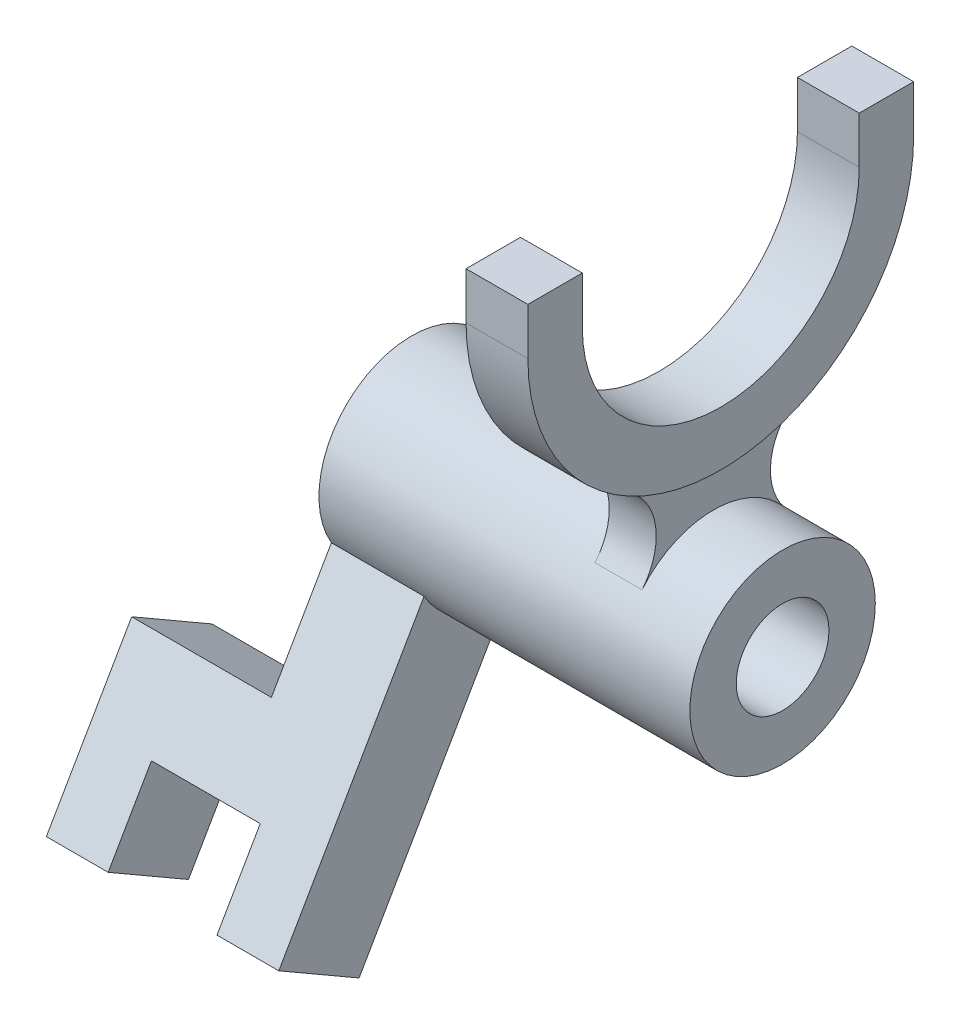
from build123d import *

# Parameters (mm, degrees)
BOSS_EXTRUDE2_DEPTH      = 19.05
BOSS_EXTRUDE2_DEPTH_BACK = 57.15
SKETCH1_R                = 19.05
SKETCH1_R_2              = 9.525
EXTRUDE_THIN1_DEPTH      = 6.35
BOSS_EXTRUDE3_DEPTH      = 4.826
BOSS_EXTRUDE4_DEPTH      = 9.525


with BuildPart() as part:
    # Sketch1 → Boss-Extrude2 (new, two sides: drawn at the far end of the back side and taken through both)
    with BuildSketch(Plane(origin=(0, 0, 0), x_dir=(0, 0, -1), z_dir=(1, 0, 0)).offset(-BOSS_EXTRUDE2_DEPTH_BACK)):
        Circle(SKETCH1_R)
        Circle(SKETCH1_R_2, mode=Mode.SUBTRACT)
    extrude(amount=BOSS_EXTRUDE2_DEPTH + BOSS_EXTRUDE2_DEPTH_BACK)



with BuildPart() as body_2:
    # Sketch3 → Extrude-Thin1 (new, symmetric)
    with BuildSketch(Plane(origin=(0, 0, 0), x_dir=(0, 0, -1), z_dir=(1, 0, 0))):
        with BuildLine():
            Line((-39.624, 76.2), (-39.624, 66.548))
            ThreePointArc((-39.624, 66.548), (0, 26.924), (39.624, 66.548))
            Line((39.624, 66.548), (39.624, 76.2))
            Line((39.624, 76.2), (28.448, 76.2))
            Line((28.448, 76.2), (28.448, 66.548))
            ThreePointArc((28.448, 66.548), (0, 38.1), (-28.448, 66.548))
            Line((-28.448, 66.548), (-28.448, 76.2))
            Line((-28.448, 76.2), (-39.624, 76.2))
        make_face()
    extrude(amount=EXTRUDE_THIN1_DEPTH, both=True)


with BuildPart() as part_1:
    add(part.part)

    add(body_2.part)  # Boss-Extrude3 merges body 2
    # Sketch4 → Boss-Extrude3 (add, symmetric)
    with BuildSketch(Plane(origin=(0, 0, 0), x_dir=(0, 0, -1), z_dir=(1, 0, 0))):
        with BuildLine():
            ThreePointArc((-18.501121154, 31.508452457), (0, 26.924), (18.501121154, 31.508452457))
            ThreePointArc((18.501121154, 31.508452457), (11.974406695, 22.752517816), (14.658580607, 12.166696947))
            ThreePointArc((14.658580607, 12.166696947), (0, 19.05), (-14.658580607, 12.166696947))
            ThreePointArc((-14.658580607, 12.166696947), (-11.974406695, 22.752517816), (-18.501121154, 31.508452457))
        make_face()
    extrude(amount=BOSS_EXTRUDE3_DEPTH, both=True)

    # Sketch5 → Boss-Extrude4 (add, symmetric)
    with BuildSketch(Plane(origin=(0, 0, 0), x_dir=(1, 0, 0), z_dir=(0, 0.500000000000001, 0.866025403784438))):
        Polygon((-57.15, -9.525), (-57.15, -41.148), (-85.852, -41.148), (-85.852, -76.2), (-73.152, -76.2), (-73.152, -58.42), (-50.8, -58.42), (-50.8, -76.2), (-38.1, -76.2), (-38.1, -9.525), align=None)
    extrude(amount=BOSS_EXTRUDE4_DEPTH, both=True)


solid = part_1.part
